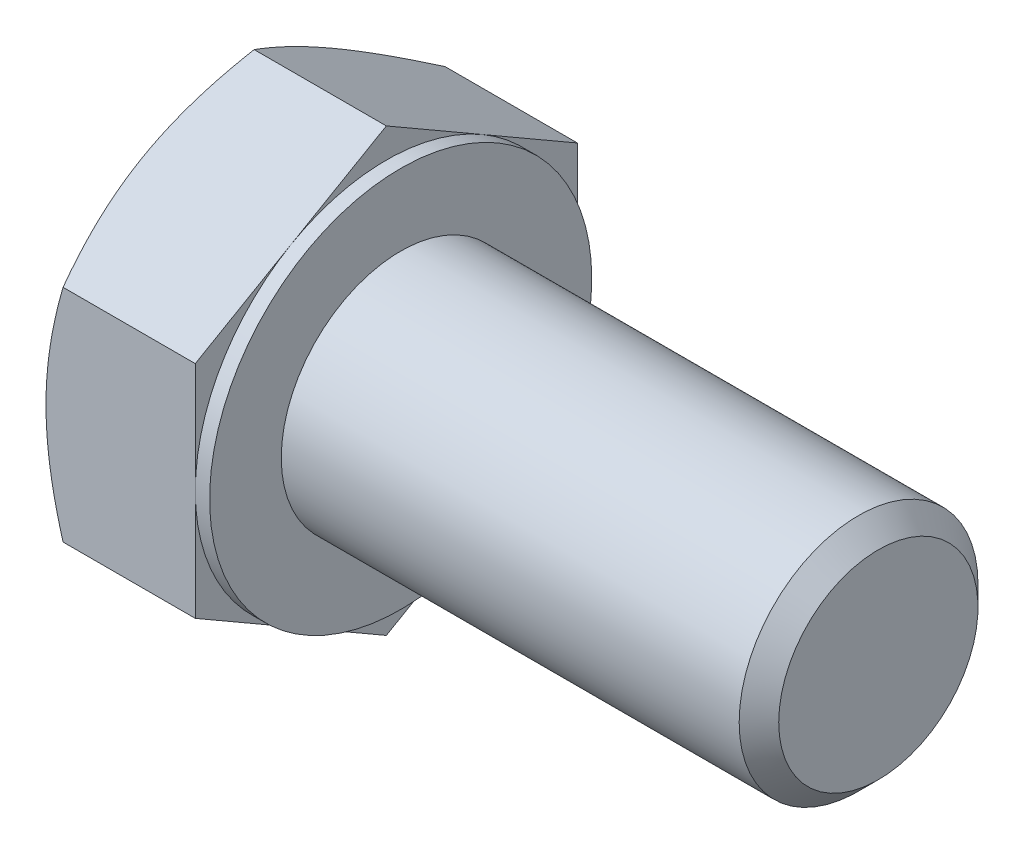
ISO-10303-21;
HEADER;
FILE_DESCRIPTION(('STEP AP214'),'2;1');
FILE_NAME('part.step','',(''),(''),'','','');
FILE_SCHEMA(('AUTOMOTIVE_DESIGN { 1 0 10303 214 1 1 1 1 }'));
ENDSEC;
DATA;
#1=APPLICATION_CONTEXT('core data for automotive mechanical design processes');
#2=APPLICATION_PROTOCOL_DEFINITION('international standard','automotive_design',2000,#1);
#3=PRODUCT_CONTEXT('',#1,'mechanical');
#4=PRODUCT('Part','Part','',(#3));
#5=PRODUCT_RELATED_PRODUCT_CATEGORY('part','',(#4));
#6=PRODUCT_DEFINITION_FORMATION('','',#4);
#7=PRODUCT_DEFINITION_CONTEXT('part definition',#1,'design');
#8=PRODUCT_DEFINITION('design','',#6,#7);
#9=PRODUCT_DEFINITION_SHAPE('','',#8);
#10=(LENGTH_UNIT() NAMED_UNIT(*) SI_UNIT(.MILLI.,.METRE.));
#11=(NAMED_UNIT(*) PLANE_ANGLE_UNIT() SI_UNIT($,.RADIAN.));
#12=(NAMED_UNIT(*) SI_UNIT($,.STERADIAN.) SOLID_ANGLE_UNIT());
#13=UNCERTAINTY_MEASURE_WITH_UNIT(LENGTH_MEASURE(1.E-05),#10,'distance_accuracy_value','');
#14=(GEOMETRIC_REPRESENTATION_CONTEXT(3) GLOBAL_UNCERTAINTY_ASSIGNED_CONTEXT((#13)) GLOBAL_UNIT_ASSIGNED_CONTEXT((#10,
#11,#12)) REPRESENTATION_CONTEXT('',''));
#15=CARTESIAN_POINT('',(0.,0.,0.));
#16=DIRECTION('',(0.,0.,1.));
#17=DIRECTION('',(1.,0.,0.));
#18=AXIS2_PLACEMENT_3D('',#15,#16,#17);
#19=CARTESIAN_POINT('',(6.85,9.23760430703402,0.));
#20=DIRECTION('',(1.,0.,0.));
#21=DIRECTION('',(0.,0.,-1.));
#22=AXIS2_PLACEMENT_3D('',#19,#20,#21);
#23=PLANE('',#22);
#24=CARTESIAN_POINT('',(6.85,0.,0.));
#25=DIRECTION('',(1.,0.,0.));
#26=DIRECTION('',(0.,0.,-1.));
#27=AXIS2_PLACEMENT_3D('',#24,#25,#26);
#28=CIRCLE('',#27,5.);
#29=CARTESIAN_POINT('',(6.85,0.,-5.));
#30=VERTEX_POINT('',#29);
#31=EDGE_CURVE('E256',#30,#30,#28,.F.);
#32=ORIENTED_EDGE('',*,*,#31,.T.);
#33=EDGE_LOOP('',(#32));
#34=FACE_BOUND('',#33,.T.);
#35=CARTESIAN_POINT('',(6.85,0.,0.));
#36=DIRECTION('',(1.,0.,0.));
#37=DIRECTION('',(0.,0.,-1.));
#38=AXIS2_PLACEMENT_3D('',#35,#36,#37);
#39=CIRCLE('',#38,8.);
#40=CARTESIAN_POINT('',(6.85,0.,-8.));
#41=VERTEX_POINT('',#40);
#42=EDGE_CURVE('E259',#41,#41,#39,.T.);
#43=ORIENTED_EDGE('',*,*,#42,.T.);
#44=EDGE_LOOP('',(#43));
#45=FACE_BOUND('',#44,.T.);
#46=ADVANCED_FACE('F37',(#34,#45),#23,.T.);
#47=CARTESIAN_POINT('',(0.,0.,0.));
#48=DIRECTION('',(-1.,0.,0.));
#49=DIRECTION('',(0.,0.,1.));
#50=AXIS2_PLACEMENT_3D('',#47,#48,#49);
#51=CYLINDRICAL_SURFACE('',#50,5.);
#52=ORIENTED_EDGE('',*,*,#31,.F.);
#53=EDGE_LOOP('',(#52));
#54=FACE_BOUND('',#53,.T.);
#55=CARTESIAN_POINT('',(26.022,0.,0.));
#56=DIRECTION('',(-1.,0.,0.));
#57=DIRECTION('',(0.,0.,1.));
#58=AXIS2_PLACEMENT_3D('',#55,#56,#57);
#59=CIRCLE('',#58,5.);
#60=CARTESIAN_POINT('',(26.022,0.,5.));
#61=VERTEX_POINT('',#60);
#62=EDGE_CURVE('E279',#61,#61,#59,.T.);
#63=ORIENTED_EDGE('',*,*,#62,.T.);
#64=EDGE_LOOP('',(#63));
#65=FACE_BOUND('',#64,.T.);
#66=ADVANCED_FACE('F245',(#54,#65),#51,.T.);
#67=CARTESIAN_POINT('',(26.85,0.,0.));
#68=DIRECTION('',(-1.,0.,0.));
#69=DIRECTION('',(0.,0.,1.));
#70=AXIS2_PLACEMENT_3D('',#67,#68,#69);
#71=CONICAL_SURFACE('',#70,4.172,0.785398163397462);
#72=ORIENTED_EDGE('',*,*,#62,.F.);
#73=EDGE_LOOP('',(#72));
#74=FACE_BOUND('',#73,.T.);
#75=CARTESIAN_POINT('',(26.85,0.,0.));
#76=DIRECTION('',(-1.,0.,0.));
#77=DIRECTION('',(0.,0.,1.));
#78=AXIS2_PLACEMENT_3D('',#75,#76,#77);
#79=CIRCLE('',#78,4.172);
#80=CARTESIAN_POINT('',(26.85,0.,4.172));
#81=VERTEX_POINT('',#80);
#82=EDGE_CURVE('E281',#81,#81,#79,.T.);
#83=ORIENTED_EDGE('',*,*,#82,.T.);
#84=EDGE_LOOP('',(#83));
#85=FACE_BOUND('',#84,.T.);
#86=ADVANCED_FACE('F250',(#74,#85),#71,.T.);
#87=CARTESIAN_POINT('',(26.85,0.,0.));
#88=DIRECTION('',(-1.,0.,0.));
#89=DIRECTION('',(0.,0.,1.));
#90=AXIS2_PLACEMENT_3D('',#87,#88,#89);
#91=PLANE('',#90);
#92=ORIENTED_EDGE('',*,*,#82,.F.);
#93=EDGE_LOOP('',(#92));
#94=FACE_BOUND('',#93,.T.);
#95=ADVANCED_FACE('F345',(#94),#91,.F.);
#96=CARTESIAN_POINT('',(6.25,8.,0.));
#97=DIRECTION('',(1.,0.,0.));
#98=DIRECTION('',(0.,0.,-1.));
#99=AXIS2_PLACEMENT_3D('',#96,#97,#98);
#100=PLANE('',#99);
#101=DIRECTION('',(0.,0.500000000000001,0.866025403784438));
#102=VECTOR('',#101,1.);
#103=CARTESIAN_POINT('',(6.25,4.618802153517,-8.));
#104=LINE('',#103,#102);
#105=CARTESIAN_POINT('',(6.25,4.618802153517,-8.));
#106=VERTEX_POINT('',#105);
#107=CARTESIAN_POINT('',(6.25,6.92820323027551,-4.00000000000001));
#108=VERTEX_POINT('',#107);
#109=EDGE_CURVE('E170',#106,#108,#104,.T.);
#110=ORIENTED_EDGE('',*,*,#109,.T.);
#111=CARTESIAN_POINT('',(6.25,0.,0.));
#112=DIRECTION('',(-1.,0.,0.));
#113=DIRECTION('',(0.,0.,1.));
#114=AXIS2_PLACEMENT_3D('',#111,#112,#113);
#115=CIRCLE('',#114,8.);
#116=CARTESIAN_POINT('',(6.25,0.,-8.));
#117=VERTEX_POINT('',#116);
#118=EDGE_CURVE('E53',#108,#117,#115,.T.);
#119=ORIENTED_EDGE('',*,*,#118,.T.);
#120=DIRECTION('',(0.,1.,0.));
#121=VECTOR('',#120,1.);
#122=CARTESIAN_POINT('',(6.25,4.618802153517,-8.));
#123=LINE('',#122,#121);
#124=EDGE_CURVE('E42',#117,#106,#123,.T.);
#125=ORIENTED_EDGE('',*,*,#124,.T.);
#126=EDGE_LOOP('',(#110,#119,#125));
#127=FACE_BOUND('',#126,.T.);
#128=ADVANCED_FACE('F337',(#127),#100,.T.);
#129=CARTESIAN_POINT('',(6.25,9.23760430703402,0.));
#130=VERTEX_POINT('',#129);
#131=EDGE_CURVE('E168',#108,#130,#104,.T.);
#132=ORIENTED_EDGE('',*,*,#131,.T.);
#133=DIRECTION('',(0.,-0.500000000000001,0.866025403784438));
#134=VECTOR('',#133,1.);
#135=CARTESIAN_POINT('',(6.25,9.23760430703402,0.));
#136=LINE('',#135,#134);
#137=CARTESIAN_POINT('',(6.25,6.92820323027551,4.00000000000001));
#138=VERTEX_POINT('',#137);
#139=EDGE_CURVE('E167',#130,#138,#136,.T.);
#140=ORIENTED_EDGE('',*,*,#139,.T.);
#141=EDGE_CURVE('E156',#138,#108,#115,.T.);
#142=ORIENTED_EDGE('',*,*,#141,.T.);
#143=EDGE_LOOP('',(#132,#140,#142));
#144=FACE_BOUND('',#143,.T.);
#145=ADVANCED_FACE('F339',(#144),#100,.T.);
#146=CARTESIAN_POINT('',(6.25,4.61880215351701,8.));
#147=VERTEX_POINT('',#146);
#148=EDGE_CURVE('E135',#138,#147,#136,.T.);
#149=ORIENTED_EDGE('',*,*,#148,.T.);
#150=DIRECTION('',(0.,-1.,0.));
#151=VECTOR('',#150,1.);
#152=CARTESIAN_POINT('',(6.25,4.61880215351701,8.));
#153=LINE('',#152,#151);
#154=CARTESIAN_POINT('',(6.25,0.,8.));
#155=VERTEX_POINT('',#154);
#156=EDGE_CURVE('E129',#147,#155,#153,.T.);
#157=ORIENTED_EDGE('',*,*,#156,.T.);
#158=EDGE_CURVE('E133',#155,#138,#115,.T.);
#159=ORIENTED_EDGE('',*,*,#158,.T.);
#160=EDGE_LOOP('',(#149,#157,#159));
#161=FACE_BOUND('',#160,.T.);
#162=ADVANCED_FACE('F131',(#161),#100,.T.);
#163=CARTESIAN_POINT('',(6.25,-4.618802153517,8.));
#164=VERTEX_POINT('',#163);
#165=EDGE_CURVE('E139',#155,#164,#153,.T.);
#166=ORIENTED_EDGE('',*,*,#165,.T.);
#167=DIRECTION('',(0.,-0.500000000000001,-0.866025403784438));
#168=VECTOR('',#167,1.);
#169=CARTESIAN_POINT('',(6.25,-9.23760430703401,0.));
#170=LINE('',#169,#168);
#171=CARTESIAN_POINT('',(6.25,-6.92820323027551,4.00000000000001));
#172=VERTEX_POINT('',#171);
#173=EDGE_CURVE('E146',#164,#172,#170,.T.);
#174=ORIENTED_EDGE('',*,*,#173,.T.);
#175=EDGE_CURVE('E143',#172,#155,#115,.T.);
#176=ORIENTED_EDGE('',*,*,#175,.T.);
#177=EDGE_LOOP('',(#166,#174,#176));
#178=FACE_BOUND('',#177,.T.);
#179=ADVANCED_FACE('F144',(#178),#100,.T.);
#180=CARTESIAN_POINT('',(6.25,-9.23760430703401,0.));
#181=VERTEX_POINT('',#180);
#182=EDGE_CURVE('E162',#172,#181,#170,.T.);
#183=ORIENTED_EDGE('',*,*,#182,.T.);
#184=DIRECTION('',(0.,0.5,-0.866025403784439));
#185=VECTOR('',#184,1.);
#186=CARTESIAN_POINT('',(6.25,-4.61880215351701,-8.));
#187=LINE('',#186,#185);
#188=CARTESIAN_POINT('',(6.25,-6.92820323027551,-4.));
#189=VERTEX_POINT('',#188);
#190=EDGE_CURVE('E331',#181,#189,#187,.T.);
#191=ORIENTED_EDGE('',*,*,#190,.T.);
#192=EDGE_CURVE('E150',#189,#172,#115,.T.);
#193=ORIENTED_EDGE('',*,*,#192,.T.);
#194=EDGE_LOOP('',(#183,#191,#193));
#195=FACE_BOUND('',#194,.T.);
#196=ADVANCED_FACE('F352',(#195),#100,.T.);
#197=CARTESIAN_POINT('',(6.25,-4.61880215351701,-8.));
#198=VERTEX_POINT('',#197);
#199=EDGE_CURVE('E157',#189,#198,#187,.T.);
#200=ORIENTED_EDGE('',*,*,#199,.T.);
#201=EDGE_CURVE('E11',#198,#117,#123,.T.);
#202=ORIENTED_EDGE('',*,*,#201,.T.);
#203=EDGE_CURVE('E336',#117,#189,#115,.T.);
#204=ORIENTED_EDGE('',*,*,#203,.T.);
#205=EDGE_LOOP('',(#200,#202,#204));
#206=FACE_BOUND('',#205,.T.);
#207=ADVANCED_FACE('F334',(#206),#100,.T.);
#208=CARTESIAN_POINT('',(0.,0.,0.));
#209=DIRECTION('',(-1.,0.,0.));
#210=DIRECTION('',(0.,0.,1.));
#211=AXIS2_PLACEMENT_3D('',#208,#209,#210);
#212=CYLINDRICAL_SURFACE('',#211,8.);
#213=ORIENTED_EDGE('',*,*,#118,.F.);
#214=ORIENTED_EDGE('',*,*,#141,.F.);
#215=ORIENTED_EDGE('',*,*,#158,.F.);
#216=ORIENTED_EDGE('',*,*,#175,.F.);
#217=ORIENTED_EDGE('',*,*,#192,.F.);
#218=ORIENTED_EDGE('',*,*,#203,.F.);
#219=EDGE_LOOP('',(#213,#214,#215,#216,#217,#218));
#220=FACE_BOUND('',#219,.T.);
#221=ORIENTED_EDGE('',*,*,#42,.F.);
#222=EDGE_LOOP('',(#221));
#223=FACE_BOUND('',#222,.T.);
#224=ADVANCED_FACE('F153',(#220,#223),#212,.T.);
#225=CARTESIAN_POINT('',(0.,9.23760430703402,0.));
#226=DIRECTION('',(1.,0.,0.));
#227=DIRECTION('',(0.,0.,-1.));
#228=AXIS2_PLACEMENT_3D('',#225,#226,#227);
#229=PLANE('',#228);
#230=CARTESIAN_POINT('',(0.,0.,0.));
#231=DIRECTION('',(1.,0.,0.));
#232=DIRECTION('',(0.,0.,-1.));
#233=AXIS2_PLACEMENT_3D('',#230,#231,#232);
#234=CIRCLE('',#233,8.);
#235=CARTESIAN_POINT('',(0.,0.,-8.));
#236=VERTEX_POINT('',#235);
#237=CARTESIAN_POINT('',(0.,6.92820323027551,-4.00000000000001));
#238=VERTEX_POINT('',#237);
#239=EDGE_CURVE('E260',#236,#238,#234,.T.);
#240=ORIENTED_EDGE('',*,*,#239,.F.);
#241=CARTESIAN_POINT('',(0.,-6.92820323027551,-4.));
#242=VERTEX_POINT('',#241);
#243=EDGE_CURVE('E263',#242,#236,#234,.T.);
#244=ORIENTED_EDGE('',*,*,#243,.F.);
#245=CARTESIAN_POINT('',(0.,-6.9282032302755,4.00000000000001));
#246=VERTEX_POINT('',#245);
#247=EDGE_CURVE('E266',#246,#242,#234,.T.);
#248=ORIENTED_EDGE('',*,*,#247,.F.);
#249=CARTESIAN_POINT('',(0.,0.,8.));
#250=VERTEX_POINT('',#249);
#251=EDGE_CURVE('E302',#250,#246,#234,.T.);
#252=ORIENTED_EDGE('',*,*,#251,.F.);
#253=CARTESIAN_POINT('',(0.,0.,0.));
#254=DIRECTION('',(-1.,0.,0.));
#255=DIRECTION('',(0.,0.,1.));
#256=AXIS2_PLACEMENT_3D('',#253,#254,#255);
#257=CIRCLE('',#256,8.);
#258=CARTESIAN_POINT('',(0.,6.92820323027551,4.00000000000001));
#259=VERTEX_POINT('',#258);
#260=EDGE_CURVE('E171',#250,#259,#257,.T.);
#261=ORIENTED_EDGE('',*,*,#260,.T.);
#262=EDGE_CURVE('E261',#238,#259,#234,.T.);
#263=ORIENTED_EDGE('',*,*,#262,.F.);
#264=EDGE_LOOP('',(#240,#244,#248,#252,#261,#263));
#265=FACE_BOUND('',#264,.T.);
#266=ADVANCED_FACE('F303',(#265),#229,.F.);
#267=CARTESIAN_POINT('',(0.,0.,0.));
#268=DIRECTION('',(1.,0.,0.));
#269=DIRECTION('',(0.,0.,-1.));
#270=AXIS2_PLACEMENT_3D('',#267,#268,#269);
#271=CONICAL_SURFACE('',#270,8.,1.0471975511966);
#272=CARTESIAN_POINT('',(0.714597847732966,4.61868668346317,8.0002));
#273=CARTESIAN_POINT('',(0.655990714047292,4.72021302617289,7.8243512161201));
#274=CARTESIAN_POINT('',(0.600043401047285,4.82211789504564,7.64784680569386));
#275=CARTESIAN_POINT('',(0.494201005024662,5.02675523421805,7.29340453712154));
#276=CARTESIAN_POINT('',(0.444308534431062,5.12948804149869,7.11546609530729));
#277=CARTESIAN_POINT('',(0.304692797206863,5.43933133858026,6.57880176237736));
#278=CARTESIAN_POINT('',(0.225281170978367,5.64766491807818,6.21795741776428));
#279=CARTESIAN_POINT('',(0.132161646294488,5.95943209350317,5.67796082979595));
#280=CARTESIAN_POINT('',(0.105634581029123,6.06193429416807,5.50042181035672));
#281=CARTESIAN_POINT('',(0.0611531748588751,6.26740224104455,5.1445408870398));
#282=CARTESIAN_POINT('',(0.04319807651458,6.37036794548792,4.96619905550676));
#283=CARTESIAN_POINT('',(0.0163156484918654,6.57647664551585,4.60920831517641));
#284=CARTESIAN_POINT('',(0.00737807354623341,6.67961930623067,4.4305599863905));
#285=CARTESIAN_POINT('',(-0.00127769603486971,6.88599991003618,4.07309829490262));
#286=CARTESIAN_POINT('',(-0.000996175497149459,6.98923785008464,3.89428493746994));
#287=CARTESIAN_POINT('',(0.00814502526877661,7.18224506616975,3.5599866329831));
#288=CARTESIAN_POINT('',(0.0158896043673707,7.27202796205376,3.40447809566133));
#289=CARTESIAN_POINT('',(0.0382011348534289,7.45138347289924,3.09382523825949));
#290=CARTESIAN_POINT('',(0.0527685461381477,7.54095607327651,2.93868094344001));
#291=CARTESIAN_POINT('',(0.106360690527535,7.80932710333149,2.47384868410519));
#292=CARTESIAN_POINT('',(0.155268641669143,7.98765049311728,2.16498351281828));
#293=CARTESIAN_POINT('',(0.277539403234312,8.34618890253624,1.5439767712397));
#294=CARTESIAN_POINT('',(0.351420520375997,8.52635816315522,1.23191445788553));
#295=CARTESIAN_POINT('',(0.519100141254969,8.88400987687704,0.612443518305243));
#296=CARTESIAN_POINT('',(0.612859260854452,9.06149691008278,0.30502695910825));
#297=CARTESIAN_POINT('',(0.714597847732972,9.23771977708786,-0.00019999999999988));
#298=B_SPLINE_CURVE_WITH_KNOTS('',3,(#272,#273,#274,#275,#276,#277,#278,#279,#280,#281,#282,
#283,#284,#285,#286,#287,#288,#289,#290,#291,#292,#293,#294,#295,#296,#297),.UNSPECIFIED.,.F.,
.F.,(4,2,2,2,2,2,2,2,2,2,2,2,4),(0.,0.633973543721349,1.26821965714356,2.53934712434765,
3.15934343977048,3.77928496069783,4.39852133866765,5.01773858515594,5.55680239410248,
6.09590254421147,7.17487077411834,8.27776850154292,9.37850115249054),.UNSPECIFIED.);
#299=CARTESIAN_POINT('',(0.714531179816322,9.23760430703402,0.));
#300=VERTEX_POINT('',#299);
#301=EDGE_CURVE('E217',#259,#300,#298,.T.);
#302=ORIENTED_EDGE('',*,*,#301,.T.);
#303=CARTESIAN_POINT('',(0.714597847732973,9.23771977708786,0.0002));
#304=CARTESIAN_POINT('',(0.655990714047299,9.13619343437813,-0.175648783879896));
#305=CARTESIAN_POINT('',(0.600043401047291,9.03428856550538,-0.352153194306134));
#306=CARTESIAN_POINT('',(0.494201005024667,8.82965122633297,-0.706595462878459));
#307=CARTESIAN_POINT('',(0.444308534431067,8.72691841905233,-0.884533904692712));
#308=CARTESIAN_POINT('',(0.304692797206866,8.41707512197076,-1.42119823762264));
#309=CARTESIAN_POINT('',(0.22528117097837,8.20874154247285,-1.78204258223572));
#310=CARTESIAN_POINT('',(0.13216164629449,7.89697436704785,-2.32203917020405));
#311=CARTESIAN_POINT('',(0.105634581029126,7.79447216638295,-2.49957818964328));
#312=CARTESIAN_POINT('',(0.0611531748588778,7.58900421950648,-2.8554591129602));
#313=CARTESIAN_POINT('',(0.0431980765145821,7.4860385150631,-3.03380094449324));
#314=CARTESIAN_POINT('',(0.0163156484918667,7.27992981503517,-3.39079168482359));
#315=CARTESIAN_POINT('',(0.00737807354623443,7.17678715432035,-3.5694400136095));
#316=CARTESIAN_POINT('',(-0.00127769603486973,6.97040655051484,-3.92690170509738));
#317=CARTESIAN_POINT('',(-0.000996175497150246,6.86716861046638,-4.10571506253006));
#318=CARTESIAN_POINT('',(0.0081450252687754,6.67416139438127,-4.4400133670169));
#319=CARTESIAN_POINT('',(0.0158896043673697,6.58437849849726,-4.59552190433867));
#320=CARTESIAN_POINT('',(0.0382011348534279,6.40502298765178,-4.90617476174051));
#321=CARTESIAN_POINT('',(0.0527685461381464,6.31545038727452,-5.06131905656));
#322=CARTESIAN_POINT('',(0.106360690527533,6.04707935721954,-5.52615131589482));
#323=CARTESIAN_POINT('',(0.155268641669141,5.86875596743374,-5.83501648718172));
#324=CARTESIAN_POINT('',(0.277539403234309,5.51021755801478,-6.4560232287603));
#325=CARTESIAN_POINT('',(0.351420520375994,5.3300482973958,-6.76808554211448));
#326=CARTESIAN_POINT('',(0.519100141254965,4.97239658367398,-7.38755648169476));
#327=CARTESIAN_POINT('',(0.612859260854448,4.79490955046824,-7.69497304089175));
#328=CARTESIAN_POINT('',(0.714597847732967,4.61868668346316,-8.0002));
#329=B_SPLINE_CURVE_WITH_KNOTS('',3,(#303,#304,#305,#306,#307,#308,#309,#310,#311,#312,#313,
#314,#315,#316,#317,#318,#319,#320,#321,#322,#323,#324,#325,#326,#327,#328),.UNSPECIFIED.,.F.,
.F.,(4,2,2,2,2,2,2,2,2,2,2,2,4),(0.,0.63397354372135,1.26821965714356,2.53934712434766,
3.15934343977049,3.77928496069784,4.39852133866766,5.01773858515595,5.55680239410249,
6.09590254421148,7.17487077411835,8.27776850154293,9.37850115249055),.UNSPECIFIED.);
#330=EDGE_CURVE('E61',#300,#238,#329,.T.);
#331=ORIENTED_EDGE('',*,*,#330,.T.);
#332=ORIENTED_EDGE('',*,*,#262,.T.);
#333=EDGE_LOOP('',(#302,#331,#332));
#334=FACE_BOUND('',#333,.T.);
#335=ADVANCED_FACE('F299',(#334),#271,.T.);
#336=CARTESIAN_POINT('',(4.02490591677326,-12.6546855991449,8.));
#337=CARTESIAN_POINT('',(3.85338488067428,-12.3031246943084,8.));
#338=CARTESIAN_POINT('',(3.68343820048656,-11.9507829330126,8.));
#339=CARTESIAN_POINT('',(3.3475742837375,-11.2441233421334,8.));
#340=CARTESIAN_POINT('',(3.18165763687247,-10.8898052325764,8.));
#341=CARTESIAN_POINT('',(2.85395194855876,-10.1770689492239,8.));
#342=CARTESIAN_POINT('',(2.69218825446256,-9.81863908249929,8.));
#343=CARTESIAN_POINT('',(2.37495727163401,-9.09901413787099,8.));
#344=CARTESIAN_POINT('',(2.21948970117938,-8.73781918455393,8.));
#345=CARTESIAN_POINT('',(1.91124909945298,-7.9995005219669,8.));
#346=CARTESIAN_POINT('',(1.75875676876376,-7.6222589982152,8.));
#347=CARTESIAN_POINT('',(1.46472411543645,-6.86345577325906,8.));
#348=CARTESIAN_POINT('',(1.323184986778,-6.48189360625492,8.));
#349=CARTESIAN_POINT('',(1.05459432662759,-5.71447512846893,8.));
#350=CARTESIAN_POINT('',(0.927515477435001,-5.32862847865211,8.));
#351=CARTESIAN_POINT('',(0.69175721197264,-4.55141880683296,8.));
#352=CARTESIAN_POINT('',(0.583072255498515,-4.16005748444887,8.));
#353=CARTESIAN_POINT('',(0.389750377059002,-3.37376378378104,8.));
#354=CARTESIAN_POINT('',(0.304973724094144,-2.97886668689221,8.));
#355=CARTESIAN_POINT('',(0.199275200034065,-2.38273452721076,8.));
#356=CARTESIAN_POINT('',(0.167618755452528,-2.18337977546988,8.));
#357=CARTESIAN_POINT('',(0.112075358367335,-1.78359737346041,8.));
#358=CARTESIAN_POINT('',(0.0881876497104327,-1.58316982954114,8.));
#359=CARTESIAN_POINT('',(0.0489706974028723,-1.184235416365,8.));
#360=CARTESIAN_POINT('',(0.0335291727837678,-0.985739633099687,8.));
#361=CARTESIAN_POINT('',(0.0110629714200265,-0.58827208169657,8.));
#362=CARTESIAN_POINT('',(0.00403814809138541,-0.38930032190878,8.));
#363=CARTESIAN_POINT('',(-0.00142584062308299,0.00876221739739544,8.));
#364=CARTESIAN_POINT('',(0.000134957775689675,0.207852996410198,8.));
#365=CARTESIAN_POINT('',(0.0118014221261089,0.605786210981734,8.));
#366=CARTESIAN_POINT('',(0.0219074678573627,0.804628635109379,8.));
#367=CARTESIAN_POINT('',(0.0557165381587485,1.27520492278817,8.));
#368=CARTESIAN_POINT('',(0.0830672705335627,1.5466829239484,8.));
#369=CARTESIAN_POINT('',(0.152259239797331,2.08777093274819,8.));
#370=CARTESIAN_POINT('',(0.194102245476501,2.35738070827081,8.));
#371=CARTESIAN_POINT('',(0.33916319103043,3.1630177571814,7.99999999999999));
#372=CARTESIAN_POINT('',(0.461891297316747,3.69558689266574,8.));
#373=CARTESIAN_POINT('',(0.676586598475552,4.49226054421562,8.));
#374=CARTESIAN_POINT('',(0.754301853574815,4.76044513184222,8.));
#375=CARTESIAN_POINT('',(0.918275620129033,5.29421545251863,8.));
#376=CARTESIAN_POINT('',(1.00453419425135,5.55980116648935,8.));
#377=CARTESIAN_POINT('',(1.1841720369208,6.08844838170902,8.));
#378=CARTESIAN_POINT('',(1.27754932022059,6.35151056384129,8.));
#379=CARTESIAN_POINT('',(1.47027925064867,6.8754242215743,8.));
#380=CARTESIAN_POINT('',(1.56963178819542,7.1362757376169,7.99999999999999));
#381=CARTESIAN_POINT('',(1.83061788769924,7.80218876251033,7.99999999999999));
#382=CARTESIAN_POINT('',(1.99585031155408,8.20583801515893,7.99999999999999));
#383=CARTESIAN_POINT('',(2.33560644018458,9.00922091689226,7.99999999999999));
#384=CARTESIAN_POINT('',(2.51013099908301,9.40895420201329,7.99999999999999));
#385=CARTESIAN_POINT('',(2.86641485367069,10.2053302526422,7.99999999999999));
#386=CARTESIAN_POINT('',(3.04817649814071,10.6019719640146,7.99999999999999));
#387=CARTESIAN_POINT('',(3.41731475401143,11.3926098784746,7.99999999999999));
#388=CARTESIAN_POINT('',(3.60469118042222,11.7866061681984,7.99999999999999));
#389=CARTESIAN_POINT('',(3.98417977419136,12.5730081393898,7.99999999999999));
#390=CARTESIAN_POINT('',(4.17629838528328,12.9654107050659,7.99999999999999));
#391=CARTESIAN_POINT('',(4.56413461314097,13.7484335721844,7.99999999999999));
#392=CARTESIAN_POINT('',(4.75985225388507,14.1390538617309,7.99999999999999));
#393=CARTESIAN_POINT('',(5.15417791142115,14.9187387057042,7.99999999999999));
#394=CARTESIAN_POINT('',(5.35278537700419,15.3078035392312,7.99999999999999));
#395=CARTESIAN_POINT('',(5.75241278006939,16.0846929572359,7.99999999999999));
#396=CARTESIAN_POINT('',(5.95343272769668,16.4725175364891,7.99999999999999));
#397=CARTESIAN_POINT('',(6.52023158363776,17.559169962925,7.99999999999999));
#398=CARTESIAN_POINT('',(6.88826669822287,18.2568208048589,7.99999999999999));
#399=CARTESIAN_POINT('',(7.62911646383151,19.6496204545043,7.99999999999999));
#400=CARTESIAN_POINT('',(8.00193136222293,20.3447691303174,7.99999999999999));
#401=CARTESIAN_POINT('',(8.74998840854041,21.7309493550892,7.99999999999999));
#402=CARTESIAN_POINT('',(9.12521930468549,22.4219869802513,7.99999999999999));
#403=CARTESIAN_POINT('',(9.69012626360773,23.4573861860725,7.99999999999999));
#404=CARTESIAN_POINT('',(9.87876537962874,23.8023143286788,7.99999999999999));
#405=CARTESIAN_POINT('',(10.2566598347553,24.491832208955,7.99999999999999));
#406=CARTESIAN_POINT('',(10.4459151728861,24.8364219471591,7.99999999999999));
#407=CARTESIAN_POINT('',(10.6354414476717,25.1808626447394,7.99999999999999));
#408=B_SPLINE_CURVE_WITH_KNOTS('',3,(#336,#337,#338,#339,#340,#341,#342,#343,#344,#345,#346,
#347,#348,#349,#350,#351,#352,#353,#354,#355,#356,#357,#358,#359,#360,#361,#362,#363,#364,#365,
#366,#367,#368,#369,#370,#371,#372,#373,#374,#375,#376,#377,#378,#379,#380,#381,#382,#383,#384,
#385,#386,#387,#388,#389,#390,#391,#392,#393,#394,#395,#396,#397,#398,#399,#400,#401,#402,#403,
#404,#405,#406,#407),.UNSPECIFIED.,.F.,.F.,(4,2,2,2,2,2,2,2,2,2,2,2,2,2,2,2,2,2,2,2,2,2,2,2,2,2,
2,2,2,2,2,2,2,2,2,4),(0.,1.17352534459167,2.34722138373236,3.52689945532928,4.70652468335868,
5.92708318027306,7.14777454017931,8.36612013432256,9.58409810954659,10.7948027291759,
11.40023293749,12.0056041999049,12.6027191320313,13.1998236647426,13.7969256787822,
14.3940542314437,15.2121538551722,16.0303533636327,17.6675489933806,18.5051258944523,
19.3427089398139,20.180059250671,21.0173942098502,22.3257038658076,23.6341339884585,
24.9429922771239,26.2518074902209,27.5625113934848,28.8732240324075,30.1836898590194,
31.4941611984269,33.8604586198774,36.2268790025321,38.5858914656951,39.7653151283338,
40.9447369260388),.UNSPECIFIED.);
#409=CARTESIAN_POINT('',(0.714531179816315,4.61880215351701,8.));
#410=VERTEX_POINT('',#409);
#411=EDGE_CURVE('E229',#250,#410,#408,.T.);
#412=ORIENTED_EDGE('',*,*,#411,.T.);
#413=EDGE_CURVE('E228',#410,#259,#298,.T.);
#414=ORIENTED_EDGE('',*,*,#413,.T.);
#415=ORIENTED_EDGE('',*,*,#260,.F.);
#416=EDGE_LOOP('',(#412,#414,#415));
#417=FACE_BOUND('',#416,.T.);
#418=ADVANCED_FACE('F295',(#417),#271,.T.);
#419=CARTESIAN_POINT('',(0.714531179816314,-4.618802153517,8.));
#420=VERTEX_POINT('',#419);
#421=EDGE_CURVE('E283',#420,#250,#408,.T.);
#422=ORIENTED_EDGE('',*,*,#421,.T.);
#423=ORIENTED_EDGE('',*,*,#251,.T.);
#424=CARTESIAN_POINT('',(0.714597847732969,-9.23771977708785,-0.000199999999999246));
#425=CARTESIAN_POINT('',(0.655990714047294,-9.13619343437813,0.175648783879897));
#426=CARTESIAN_POINT('',(0.600043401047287,-9.03428856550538,0.352153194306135));
#427=CARTESIAN_POINT('',(0.494201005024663,-8.82965122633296,0.70659546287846));
#428=CARTESIAN_POINT('',(0.444308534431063,-8.72691841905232,0.884533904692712));
#429=CARTESIAN_POINT('',(0.304692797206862,-8.41707512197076,1.42119823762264));
#430=CARTESIAN_POINT('',(0.225281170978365,-8.20874154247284,1.78204258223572));
#431=CARTESIAN_POINT('',(0.132161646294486,-7.89697436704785,2.32203917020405));
#432=CARTESIAN_POINT('',(0.105634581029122,-7.79447216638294,2.49957818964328));
#433=CARTESIAN_POINT('',(0.0611531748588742,-7.58900421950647,2.8554591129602));
#434=CARTESIAN_POINT('',(0.0431980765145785,-7.4860385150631,3.03380094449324));
#435=CARTESIAN_POINT('',(0.0163156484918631,-7.27992981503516,3.39079168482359));
#436=CARTESIAN_POINT('',(0.00737807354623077,-7.17678715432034,3.5694400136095));
#437=CARTESIAN_POINT('',(-0.00127769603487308,-6.97040655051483,3.92690170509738));
#438=CARTESIAN_POINT('',(-0.000996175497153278,-6.86716861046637,4.10571506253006));
#439=CARTESIAN_POINT('',(0.0081450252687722,-6.67416139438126,4.4400133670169));
#440=CARTESIAN_POINT('',(0.0158896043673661,-6.58437849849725,4.59552190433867));
#441=CARTESIAN_POINT('',(0.0382011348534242,-6.40502298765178,4.90617476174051));
#442=CARTESIAN_POINT('',(0.052768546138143,-6.31545038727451,5.06131905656));
#443=CARTESIAN_POINT('',(0.10636069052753,-6.04707935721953,5.52615131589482));
#444=CARTESIAN_POINT('',(0.155268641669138,-5.86875596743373,5.83501648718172));
#445=CARTESIAN_POINT('',(0.277539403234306,-5.51021755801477,6.4560232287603));
#446=CARTESIAN_POINT('',(0.351420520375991,-5.3300482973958,6.76808554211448));
#447=CARTESIAN_POINT('',(0.519100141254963,-4.97239658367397,7.38755648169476));
#448=CARTESIAN_POINT('',(0.612859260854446,-4.79490955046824,7.69497304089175));
#449=CARTESIAN_POINT('',(0.714597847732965,-4.61868668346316,8.0002));
#450=B_SPLINE_CURVE_WITH_KNOTS('',3,(#424,#425,#426,#427,#428,#429,#430,#431,#432,#433,#434,
#435,#436,#437,#438,#439,#440,#441,#442,#443,#444,#445,#446,#447,#448,#449),.UNSPECIFIED.,.F.,
.F.,(4,2,2,2,2,2,2,2,2,2,2,2,4),(0.,0.63397354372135,1.26821965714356,2.53934712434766,
3.15934343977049,3.77928496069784,4.39852133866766,5.01773858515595,5.55680239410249,
6.09590254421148,7.17487077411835,8.27776850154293,9.37850115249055),.UNSPECIFIED.);
#451=EDGE_CURVE('E219',#246,#420,#450,.T.);
#452=ORIENTED_EDGE('',*,*,#451,.T.);
#453=EDGE_LOOP('',(#422,#423,#452));
#454=FACE_BOUND('',#453,.T.);
#455=ADVANCED_FACE('F189',(#454),#271,.T.);
#456=CARTESIAN_POINT('',(0.714531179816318,-9.23760430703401,0.));
#457=VERTEX_POINT('',#456);
#458=EDGE_CURVE('E212',#457,#246,#450,.T.);
#459=ORIENTED_EDGE('',*,*,#458,.T.);
#460=ORIENTED_EDGE('',*,*,#247,.T.);
#461=CARTESIAN_POINT('',(0.71459784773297,-4.61868668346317,-8.0002));
#462=CARTESIAN_POINT('',(0.655990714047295,-4.7202130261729,-7.82435121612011));
#463=CARTESIAN_POINT('',(0.600043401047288,-4.82211789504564,-7.64784680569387));
#464=CARTESIAN_POINT('',(0.494201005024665,-5.02675523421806,-7.29340453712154));
#465=CARTESIAN_POINT('',(0.444308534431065,-5.1294880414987,-7.11546609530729));
#466=CARTESIAN_POINT('',(0.304692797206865,-5.43933133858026,-6.57880176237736));
#467=CARTESIAN_POINT('',(0.225281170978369,-5.64766491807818,-6.21795741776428));
#468=CARTESIAN_POINT('',(0.132161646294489,-5.95943209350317,-5.67796082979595));
#469=CARTESIAN_POINT('',(0.105634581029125,-6.06193429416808,-5.50042181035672));
#470=CARTESIAN_POINT('',(0.0611531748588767,-6.26740224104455,-5.1445408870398));
#471=CARTESIAN_POINT('',(0.0431980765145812,-6.37036794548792,-4.96619905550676));
#472=CARTESIAN_POINT('',(0.0163156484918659,-6.57647664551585,-4.60920831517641));
#473=CARTESIAN_POINT('',(0.00737807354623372,-6.67961930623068,-4.4305599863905));
#474=CARTESIAN_POINT('',(-0.00127769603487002,-6.88599991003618,-4.07309829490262));
#475=CARTESIAN_POINT('',(-0.000996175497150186,-6.98923785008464,-3.89428493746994));
#476=CARTESIAN_POINT('',(0.00814502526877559,-7.18224506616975,-3.5599866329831));
#477=CARTESIAN_POINT('',(0.0158896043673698,-7.27202796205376,-3.40447809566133));
#478=CARTESIAN_POINT('',(0.0382011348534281,-7.45138347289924,-3.09382523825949));
#479=CARTESIAN_POINT('',(0.052768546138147,-7.54095607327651,-2.93868094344));
#480=CARTESIAN_POINT('',(0.106360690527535,-7.80932710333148,-2.47384868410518));
#481=CARTESIAN_POINT('',(0.155268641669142,-7.98765049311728,-2.16498351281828));
#482=CARTESIAN_POINT('',(0.27753940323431,-8.34618890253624,-1.5439767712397));
#483=CARTESIAN_POINT('',(0.351420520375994,-8.52635816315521,-1.23191445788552));
#484=CARTESIAN_POINT('',(0.519100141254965,-8.88400987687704,-0.61244351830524));
#485=CARTESIAN_POINT('',(0.612859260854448,-9.06149691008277,-0.305026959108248));
#486=CARTESIAN_POINT('',(0.714597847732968,-9.23771977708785,0.000200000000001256));
#487=B_SPLINE_CURVE_WITH_KNOTS('',3,(#461,#462,#463,#464,#465,#466,#467,#468,#469,#470,#471,
#472,#473,#474,#475,#476,#477,#478,#479,#480,#481,#482,#483,#484,#485,#486),.UNSPECIFIED.,.F.,
.F.,(4,2,2,2,2,2,2,2,2,2,2,2,4),(0.,0.633973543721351,1.26821965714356,2.53934712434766,
3.15934343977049,3.77928496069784,4.39852133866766,5.01773858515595,5.55680239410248,
6.09590254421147,7.17487077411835,8.27776850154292,9.37850115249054),.UNSPECIFIED.);
#488=EDGE_CURVE('E218',#242,#457,#487,.T.);
#489=ORIENTED_EDGE('',*,*,#488,.T.);
#490=EDGE_LOOP('',(#459,#460,#489));
#491=FACE_BOUND('',#490,.T.);
#492=ADVANCED_FACE('F328',(#491),#271,.T.);
#493=CARTESIAN_POINT('',(0.714531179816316,4.618802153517,-8.));
#494=VERTEX_POINT('',#493);
#495=EDGE_CURVE('E220',#238,#494,#329,.T.);
#496=ORIENTED_EDGE('',*,*,#495,.T.);
#497=CARTESIAN_POINT('',(4.02490591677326,-12.6546855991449,-8.));
#498=CARTESIAN_POINT('',(3.85338488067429,-12.3031246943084,-8.));
#499=CARTESIAN_POINT('',(3.68343820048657,-11.9507829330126,-8.));
#500=CARTESIAN_POINT('',(3.34757428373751,-11.2441233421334,-8.));
#501=CARTESIAN_POINT('',(3.18165763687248,-10.8898052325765,-8.));
#502=CARTESIAN_POINT('',(2.85395194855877,-10.177068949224,-8.));
#503=CARTESIAN_POINT('',(2.69218825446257,-9.8186390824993,-8.));
#504=CARTESIAN_POINT('',(2.37495727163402,-9.099014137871,-8.));
#505=CARTESIAN_POINT('',(2.21948970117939,-8.73781918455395,-8.));
#506=CARTESIAN_POINT('',(1.91124909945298,-7.99950052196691,-8.));
#507=CARTESIAN_POINT('',(1.75875676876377,-7.62225899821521,-8.));
#508=CARTESIAN_POINT('',(1.46472411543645,-6.86345577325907,-8.));
#509=CARTESIAN_POINT('',(1.323184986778,-6.48189360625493,-8.));
#510=CARTESIAN_POINT('',(1.05459432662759,-5.71447512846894,-8.));
#511=CARTESIAN_POINT('',(0.927515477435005,-5.32862847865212,-8.));
#512=CARTESIAN_POINT('',(0.691757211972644,-4.55141880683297,-8.));
#513=CARTESIAN_POINT('',(0.58307225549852,-4.16005748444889,-8.));
#514=CARTESIAN_POINT('',(0.389750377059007,-3.37376378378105,-8.));
#515=CARTESIAN_POINT('',(0.304973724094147,-2.97886668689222,-8.));
#516=CARTESIAN_POINT('',(0.199275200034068,-2.38273452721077,-8.));
#517=CARTESIAN_POINT('',(0.167618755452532,-2.18337977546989,-8.));
#518=CARTESIAN_POINT('',(0.112075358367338,-1.78359737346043,-8.));
#519=CARTESIAN_POINT('',(0.0881876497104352,-1.58316982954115,-8.));
#520=CARTESIAN_POINT('',(0.0489706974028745,-1.18423541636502,-8.));
#521=CARTESIAN_POINT('',(0.0335291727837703,-0.985739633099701,-8.));
#522=CARTESIAN_POINT('',(0.0110629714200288,-0.588272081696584,-8.));
#523=CARTESIAN_POINT('',(0.00403814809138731,-0.389300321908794,-8.));
#524=CARTESIAN_POINT('',(-0.00142584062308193,0.00876221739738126,-8.));
#525=CARTESIAN_POINT('',(0.000134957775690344,0.207852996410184,-8.));
#526=CARTESIAN_POINT('',(0.0118014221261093,0.605786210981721,-8.));
#527=CARTESIAN_POINT('',(0.0219074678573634,0.804628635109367,-8.));
#528=CARTESIAN_POINT('',(0.055716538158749,1.27520492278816,-8.));
#529=CARTESIAN_POINT('',(0.0830672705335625,1.54668292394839,-8.));
#530=CARTESIAN_POINT('',(0.152259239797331,2.08777093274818,-8.));
#531=CARTESIAN_POINT('',(0.194102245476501,2.3573807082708,-8.));
#532=CARTESIAN_POINT('',(0.33916319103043,3.16301775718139,-8.));
#533=CARTESIAN_POINT('',(0.461891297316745,3.69558689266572,-8.));
#534=CARTESIAN_POINT('',(0.67658659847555,4.4922605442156,-8.));
#535=CARTESIAN_POINT('',(0.754301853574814,4.76044513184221,-8.));
#536=CARTESIAN_POINT('',(0.918275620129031,5.29421545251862,-8.));
#537=CARTESIAN_POINT('',(1.00453419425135,5.55980116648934,-8.));
#538=CARTESIAN_POINT('',(1.1841720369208,6.088448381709,-8.));
#539=CARTESIAN_POINT('',(1.27754932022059,6.35151056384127,-8.));
#540=CARTESIAN_POINT('',(1.47027925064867,6.87542422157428,-8.));
#541=CARTESIAN_POINT('',(1.56963178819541,7.13627573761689,-8.));
#542=CARTESIAN_POINT('',(1.83061788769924,7.80218876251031,-8.));
#543=CARTESIAN_POINT('',(1.99585031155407,8.20583801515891,-8.));
#544=CARTESIAN_POINT('',(2.33560644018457,9.00922091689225,-8.));
#545=CARTESIAN_POINT('',(2.51013099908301,9.40895420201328,-8.));
#546=CARTESIAN_POINT('',(2.86641485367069,10.2053302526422,-8.));
#547=CARTESIAN_POINT('',(3.04817649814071,10.6019719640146,-8.));
#548=CARTESIAN_POINT('',(3.41731475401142,11.3926098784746,-8.));
#549=CARTESIAN_POINT('',(3.60469118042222,11.7866061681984,-8.));
#550=CARTESIAN_POINT('',(3.98417977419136,12.5730081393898,-8.));
#551=CARTESIAN_POINT('',(4.17629838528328,12.9654107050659,-8.));
#552=CARTESIAN_POINT('',(4.56413461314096,13.7484335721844,-8.));
#553=CARTESIAN_POINT('',(4.75985225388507,14.1390538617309,-8.));
#554=CARTESIAN_POINT('',(5.15417791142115,14.9187387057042,-8.));
#555=CARTESIAN_POINT('',(5.3527853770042,15.3078035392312,-8.));
#556=CARTESIAN_POINT('',(5.75241278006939,16.0846929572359,-8.));
#557=CARTESIAN_POINT('',(5.95343272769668,16.4725175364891,-8.));
#558=CARTESIAN_POINT('',(6.52023158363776,17.559169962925,-8.));
#559=CARTESIAN_POINT('',(6.88826669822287,18.2568208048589,-8.));
#560=CARTESIAN_POINT('',(7.62911646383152,19.6496204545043,-8.));
#561=CARTESIAN_POINT('',(8.00193136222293,20.3447691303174,-8.));
#562=CARTESIAN_POINT('',(8.74998840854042,21.7309493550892,-8.));
#563=CARTESIAN_POINT('',(9.12521930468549,22.4219869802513,-8.));
#564=CARTESIAN_POINT('',(9.69012626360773,23.4573861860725,-8.));
#565=CARTESIAN_POINT('',(9.87876537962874,23.8023143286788,-8.));
#566=CARTESIAN_POINT('',(10.2566598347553,24.491832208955,-8.));
#567=CARTESIAN_POINT('',(10.4459151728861,24.8364219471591,-8.));
#568=CARTESIAN_POINT('',(10.6354414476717,25.1808626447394,-8.));
#569=B_SPLINE_CURVE_WITH_KNOTS('',3,(#497,#498,#499,#500,#501,#502,#503,#504,#505,#506,#507,
#508,#509,#510,#511,#512,#513,#514,#515,#516,#517,#518,#519,#520,#521,#522,#523,#524,#525,#526,
#527,#528,#529,#530,#531,#532,#533,#534,#535,#536,#537,#538,#539,#540,#541,#542,#543,#544,#545,
#546,#547,#548,#549,#550,#551,#552,#553,#554,#555,#556,#557,#558,#559,#560,#561,#562,#563,#564,
#565,#566,#567,#568),.UNSPECIFIED.,.F.,.F.,(4,2,2,2,2,2,2,2,2,2,2,2,2,2,2,2,2,2,2,2,2,2,2,2,2,2,
2,2,2,2,2,2,2,2,2,4),(0.,1.17352534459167,2.34722138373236,3.52689945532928,4.70652468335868,
5.92708318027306,7.14777454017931,8.36612013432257,9.58409810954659,10.7948027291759,
11.40023293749,12.0056041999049,12.6027191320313,13.1998236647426,13.7969256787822,
14.3940542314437,15.2121538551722,16.0303533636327,17.6675489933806,18.5051258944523,
19.3427089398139,20.180059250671,21.0173942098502,22.3257038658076,23.6341339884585,
24.9429922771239,26.2518074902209,27.5625113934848,28.8732240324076,30.1836898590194,
31.4941611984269,33.8604586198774,36.2268790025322,38.5858914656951,39.7653151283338,
40.9447369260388),.UNSPECIFIED.);
#570=EDGE_CURVE('E182',#494,#236,#569,.F.);
#571=ORIENTED_EDGE('',*,*,#570,.T.);
#572=ORIENTED_EDGE('',*,*,#239,.T.);
#573=EDGE_LOOP('',(#496,#571,#572));
#574=FACE_BOUND('',#573,.T.);
#575=ADVANCED_FACE('F318',(#574),#271,.T.);
#576=CARTESIAN_POINT('',(0.714531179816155,-4.61880215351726,-8.));
#577=VERTEX_POINT('',#576);
#578=EDGE_CURVE('E183',#577,#242,#487,.T.);
#579=ORIENTED_EDGE('',*,*,#578,.T.);
#580=ORIENTED_EDGE('',*,*,#243,.T.);
#581=EDGE_CURVE('E174',#236,#577,#569,.F.);
#582=ORIENTED_EDGE('',*,*,#581,.T.);
#583=EDGE_LOOP('',(#579,#580,#582));
#584=FACE_BOUND('',#583,.T.);
#585=ADVANCED_FACE('F198',(#584),#271,.T.);
#586=CARTESIAN_POINT('',(6.85,4.618802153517,-8.));
#587=DIRECTION('',(0.,0.,1.));
#588=DIRECTION('',(0.,-1.,0.));
#589=AXIS2_PLACEMENT_3D('',#586,#587,#588);
#590=PLANE('',#589);
#591=ORIENTED_EDGE('',*,*,#201,.F.);
#592=DIRECTION('',(-1.,0.,0.));
#593=VECTOR('',#592,1.);
#594=CARTESIAN_POINT('',(6.85,-4.61880215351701,-8.));
#595=LINE('',#594,#593);
#596=EDGE_CURVE('E274',#198,#577,#595,.T.);
#597=ORIENTED_EDGE('',*,*,#596,.T.);
#598=ORIENTED_EDGE('',*,*,#581,.F.);
#599=ORIENTED_EDGE('',*,*,#570,.F.);
#600=DIRECTION('',(-1.,0.,0.));
#601=VECTOR('',#600,1.);
#602=CARTESIAN_POINT('',(6.85,4.618802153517,-8.));
#603=LINE('',#602,#601);
#604=EDGE_CURVE('E276',#106,#494,#603,.T.);
#605=ORIENTED_EDGE('',*,*,#604,.F.);
#606=ORIENTED_EDGE('',*,*,#124,.F.);
#607=EDGE_LOOP('',(#591,#597,#598,#599,#605,#606));
#608=FACE_BOUND('',#607,.T.);
#609=ADVANCED_FACE('F193',(#608),#590,.F.);
#610=CARTESIAN_POINT('',(6.85,-4.61880215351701,-8.));
#611=DIRECTION('',(0.,0.866025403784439,0.5));
#612=DIRECTION('',(0.,-0.5,0.866025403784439));
#613=AXIS2_PLACEMENT_3D('',#610,#611,#612);
#614=PLANE('',#613);
#615=ORIENTED_EDGE('',*,*,#190,.F.);
#616=DIRECTION('',(-1.,0.,0.));
#617=VECTOR('',#616,1.);
#618=CARTESIAN_POINT('',(6.85,-9.23760430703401,0.));
#619=LINE('',#618,#617);
#620=EDGE_CURVE('E272',#181,#457,#619,.T.);
#621=ORIENTED_EDGE('',*,*,#620,.T.);
#622=ORIENTED_EDGE('',*,*,#488,.F.);
#623=ORIENTED_EDGE('',*,*,#578,.F.);
#624=ORIENTED_EDGE('',*,*,#596,.F.);
#625=ORIENTED_EDGE('',*,*,#199,.F.);
#626=EDGE_LOOP('',(#615,#621,#622,#623,#624,#625));
#627=FACE_BOUND('',#626,.T.);
#628=ADVANCED_FACE('F197',(#627),#614,.F.);
#629=CARTESIAN_POINT('',(6.85,-9.23760430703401,0.));
#630=DIRECTION('',(0.,0.866025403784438,-0.500000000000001));
#631=DIRECTION('',(0.,0.500000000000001,0.866025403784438));
#632=AXIS2_PLACEMENT_3D('',#629,#630,#631);
#633=PLANE('',#632);
#634=ORIENTED_EDGE('',*,*,#173,.F.);
#635=DIRECTION('',(-1.,0.,0.));
#636=VECTOR('',#635,1.);
#637=CARTESIAN_POINT('',(6.85,-4.61880215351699,8.));
#638=LINE('',#637,#636);
#639=EDGE_CURVE('E161',#164,#420,#638,.T.);
#640=ORIENTED_EDGE('',*,*,#639,.T.);
#641=ORIENTED_EDGE('',*,*,#451,.F.);
#642=ORIENTED_EDGE('',*,*,#458,.F.);
#643=ORIENTED_EDGE('',*,*,#620,.F.);
#644=ORIENTED_EDGE('',*,*,#182,.F.);
#645=EDGE_LOOP('',(#634,#640,#641,#642,#643,#644));
#646=FACE_BOUND('',#645,.T.);
#647=ADVANCED_FACE('F204',(#646),#633,.F.);
#648=CARTESIAN_POINT('',(6.85,4.61880215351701,8.));
#649=DIRECTION('',(0.,0.,-1.));
#650=DIRECTION('',(0.,1.,0.));
#651=AXIS2_PLACEMENT_3D('',#648,#649,#650);
#652=PLANE('',#651);
#653=ORIENTED_EDGE('',*,*,#156,.F.);
#654=DIRECTION('',(-1.,0.,0.));
#655=VECTOR('',#654,1.);
#656=CARTESIAN_POINT('',(6.85,4.61880215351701,8.));
#657=LINE('',#656,#655);
#658=EDGE_CURVE('E269',#147,#410,#657,.T.);
#659=ORIENTED_EDGE('',*,*,#658,.T.);
#660=ORIENTED_EDGE('',*,*,#411,.F.);
#661=ORIENTED_EDGE('',*,*,#421,.F.);
#662=ORIENTED_EDGE('',*,*,#639,.F.);
#663=ORIENTED_EDGE('',*,*,#165,.F.);
#664=EDGE_LOOP('',(#653,#659,#660,#661,#662,#663));
#665=FACE_BOUND('',#664,.T.);
#666=ADVANCED_FACE('F159',(#665),#652,.F.);
#667=CARTESIAN_POINT('',(6.85,9.23760430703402,0.));
#668=DIRECTION('',(0.,-0.866025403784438,-0.500000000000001));
#669=DIRECTION('',(0.,0.500000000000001,-0.866025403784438));
#670=AXIS2_PLACEMENT_3D('',#667,#668,#669);
#671=PLANE('',#670);
#672=ORIENTED_EDGE('',*,*,#139,.F.);
#673=DIRECTION('',(-1.,0.,0.));
#674=VECTOR('',#673,1.);
#675=CARTESIAN_POINT('',(6.85,9.23760430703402,0.));
#676=LINE('',#675,#674);
#677=EDGE_CURVE('E267',#130,#300,#676,.T.);
#678=ORIENTED_EDGE('',*,*,#677,.T.);
#679=ORIENTED_EDGE('',*,*,#301,.F.);
#680=ORIENTED_EDGE('',*,*,#413,.F.);
#681=ORIENTED_EDGE('',*,*,#658,.F.);
#682=ORIENTED_EDGE('',*,*,#148,.F.);
#683=EDGE_LOOP('',(#672,#678,#679,#680,#681,#682));
#684=FACE_BOUND('',#683,.T.);
#685=ADVANCED_FACE('F234',(#684),#671,.F.);
#686=CARTESIAN_POINT('',(6.85,4.618802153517,-8.));
#687=DIRECTION('',(0.,-0.866025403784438,0.500000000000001));
#688=DIRECTION('',(0.,-0.500000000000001,-0.866025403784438));
#689=AXIS2_PLACEMENT_3D('',#686,#687,#688);
#690=PLANE('',#689);
#691=ORIENTED_EDGE('',*,*,#109,.F.);
#692=ORIENTED_EDGE('',*,*,#604,.T.);
#693=ORIENTED_EDGE('',*,*,#495,.F.);
#694=ORIENTED_EDGE('',*,*,#330,.F.);
#695=ORIENTED_EDGE('',*,*,#677,.F.);
#696=ORIENTED_EDGE('',*,*,#131,.F.);
#697=EDGE_LOOP('',(#691,#692,#693,#694,#695,#696));
#698=FACE_BOUND('',#697,.T.);
#699=ADVANCED_FACE('F39',(#698),#690,.F.);
#700=CLOSED_SHELL('',(#46,#66,#86,#95,#128,#145,#162,#179,#196,#207,#224,#266,#335,#418,#455,
#492,#575,#585,#609,#628,#647,#666,#685,#699));
#701=MANIFOLD_SOLID_BREP('B2',#700);
#702=ADVANCED_BREP_SHAPE_REPRESENTATION('',(#18,#701),#14);
#703=SHAPE_DEFINITION_REPRESENTATION(#9,#702);
ENDSEC;
END-ISO-10303-21;
